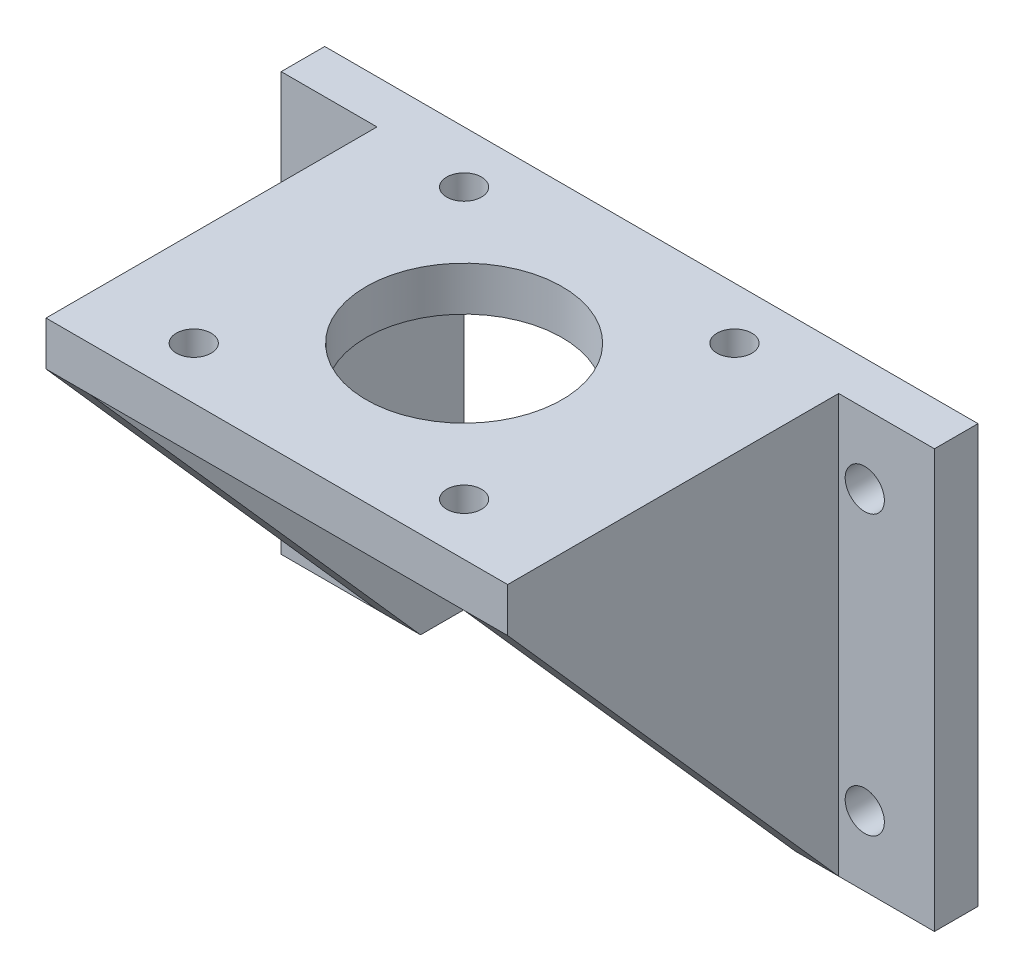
from build123d import *

# Parameters (mm, degrees)
SKETCH1_R           = 2.25
BOSS_EXTRUDE1_DEPTH = 5
SKETCH2_W           = 53
SKETCH2_H           = 5.069282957
BOSS_EXTRUDE2_DEPTH = 38
BOSS_EXTRUDE3_DEPTH = 5
BOSS_EXTRUDE4_DEPTH = 5
SKETCH5_R           = 11.25
SKETCH5_R_2         = 2
CUT_EXTRUDE1_DEPTH  = 88.372764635


with BuildPart() as part:
    # Sketch1 → Boss-Extrude1 (new body)
    with BuildSketch(Plane.XY):
        Polygon((0, 0), (0, 43), (43, 43), (43, 0), (59, 0), (59, 48), (-16, 48), (-16, 0), align=None)
        with Locations((-8, 40)):
            Circle(SKETCH1_R, mode=Mode.SUBTRACT)
        with Locations((51, 40)):
            Circle(SKETCH1_R, mode=Mode.SUBTRACT)
        with Locations((51, 8)):
            Circle(SKETCH1_R, mode=Mode.SUBTRACT)
        with Locations((-8, 8)):
            Circle(SKETCH1_R, mode=Mode.SUBTRACT)
    extrude(amount=BOSS_EXTRUDE1_DEPTH)

    # Sketch2 → Boss-Extrude2 (add)
    with BuildSketch(Plane.XY.offset(5)):
        with Locations((21.5, 45.465358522)):
            Rectangle(SKETCH2_W, SKETCH2_H)
    extrude(amount=BOSS_EXTRUDE2_DEPTH)

    # Sketch3 → Boss-Extrude3 (add)
    with BuildSketch(Plane.ZY.offset(5)):
        Polygon((5, 48), (5, 0), (43, 42.930717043), (43, 48), align=None)
    extrude(amount=-BOSS_EXTRUDE3_DEPTH)

    # Sketch4 → Boss-Extrude4 (add)
    with BuildSketch(Plane(origin=(48, 0, 0), x_dir=(0, 0, -1), z_dir=(1, 0, 0))):
        Polygon((-43, 48), (-43, 42.930717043), (-5, 0), (-5, 48), align=None)
    extrude(amount=-BOSS_EXTRUDE4_DEPTH)

    # Sketch5 → Cut-Extrude1 (cut, through all)
    with BuildSketch(Plane(origin=(0, 48, 0), x_dir=(1, 0, 0), z_dir=(0, 1, 0))):
        with Locations(Location((21.5, -21.5, 0), (0, 0, 180))):
            Circle(SKETCH5_R)
        with Locations(Location((5.98, -5.98, 0), (0, 0, 180))):
            Circle(SKETCH5_R_2)
        with Locations(Location((37.02, -5.98, 0), (0, 0, 180))):
            Circle(SKETCH5_R_2)
        with Locations(Location((37.02, -37.02, 0), (0, 0, 180))):
            Circle(SKETCH5_R_2)
        with Locations(Location((5.98, -37.02, 0), (0, 0, 180))):
            Circle(SKETCH5_R_2)
    extrude(amount=-CUT_EXTRUDE1_DEPTH, mode=Mode.SUBTRACT)


solid = part.part
